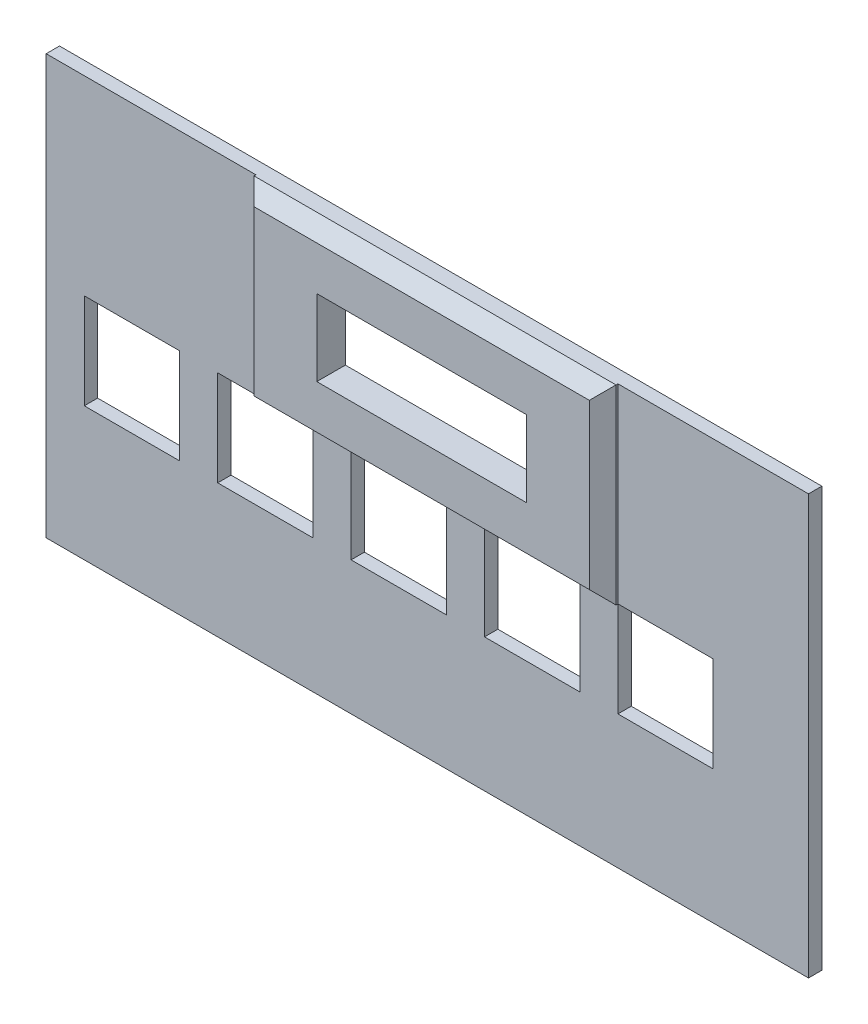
ISO-10303-21;
HEADER;
FILE_DESCRIPTION(('STEP AP214'),'2;1');
FILE_NAME('part.step','',(''),(''),'','','');
FILE_SCHEMA(('AUTOMOTIVE_DESIGN { 1 0 10303 214 1 1 1 1 }'));
ENDSEC;
DATA;
#1=APPLICATION_CONTEXT('core data for automotive mechanical design processes');
#2=APPLICATION_PROTOCOL_DEFINITION('international standard','automotive_design',2000,#1);
#3=PRODUCT_CONTEXT('',#1,'mechanical');
#4=PRODUCT('Part','Part','',(#3));
#5=PRODUCT_RELATED_PRODUCT_CATEGORY('part','',(#4));
#6=PRODUCT_DEFINITION_FORMATION('','',#4);
#7=PRODUCT_DEFINITION_CONTEXT('part definition',#1,'design');
#8=PRODUCT_DEFINITION('design','',#6,#7);
#9=PRODUCT_DEFINITION_SHAPE('','',#8);
#10=(LENGTH_UNIT() NAMED_UNIT(*) SI_UNIT(.MILLI.,.METRE.));
#11=(NAMED_UNIT(*) PLANE_ANGLE_UNIT() SI_UNIT($,.RADIAN.));
#12=(NAMED_UNIT(*) SI_UNIT($,.STERADIAN.) SOLID_ANGLE_UNIT());
#13=UNCERTAINTY_MEASURE_WITH_UNIT(LENGTH_MEASURE(1.E-05),#10,'distance_accuracy_value','');
#14=(GEOMETRIC_REPRESENTATION_CONTEXT(3) GLOBAL_UNCERTAINTY_ASSIGNED_CONTEXT((#13)) GLOBAL_UNIT_ASSIGNED_CONTEXT((#10,
#11,#12)) REPRESENTATION_CONTEXT('',''));
#15=CARTESIAN_POINT('',(0.,0.,0.));
#16=DIRECTION('',(0.,0.,1.));
#17=DIRECTION('',(1.,0.,0.));
#18=AXIS2_PLACEMENT_3D('',#15,#16,#17);
#19=CARTESIAN_POINT('',(0.,0.,0.35));
#20=DIRECTION('',(0.,0.,-1.));
#21=DIRECTION('',(-1.,0.,0.));
#22=AXIS2_PLACEMENT_3D('',#19,#20,#21);
#23=PLANE('',#22);
#24=DIRECTION('',(0.,-1.,0.));
#25=VECTOR('',#24,1.);
#26=CARTESIAN_POINT('',(-108.899490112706,112.768397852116,0.35));
#27=LINE('',#26,#25);
#28=CARTESIAN_POINT('',(-108.899490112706,112.768397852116,0.35));
#29=VERTEX_POINT('',#28);
#30=CARTESIAN_POINT('',(-108.899490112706,107.768397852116,0.35));
#31=VERTEX_POINT('',#30);
#32=EDGE_CURVE('E376',#29,#31,#27,.T.);
#33=ORIENTED_EDGE('',*,*,#32,.F.);
#34=DIRECTION('',(-1.,0.,0.));
#35=VECTOR('',#34,1.);
#36=CARTESIAN_POINT('',(-108.899490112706,112.768397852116,0.35));
#37=LINE('',#36,#35);
#38=CARTESIAN_POINT('',(-103.899490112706,112.768397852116,0.35));
#39=VERTEX_POINT('',#38);
#40=EDGE_CURVE('E384',#39,#29,#37,.T.);
#41=ORIENTED_EDGE('',*,*,#40,.F.);
#42=DIRECTION('',(0.,1.,0.));
#43=VECTOR('',#42,1.);
#44=CARTESIAN_POINT('',(-103.899490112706,112.768397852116,0.35));
#45=LINE('',#44,#43);
#46=CARTESIAN_POINT('',(-103.899490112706,107.768397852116,0.35));
#47=VERTEX_POINT('',#46);
#48=EDGE_CURVE('E381',#47,#39,#45,.T.);
#49=ORIENTED_EDGE('',*,*,#48,.F.);
#50=DIRECTION('',(1.,0.,0.));
#51=VECTOR('',#50,1.);
#52=CARTESIAN_POINT('',(-108.899490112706,107.768397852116,0.35));
#53=LINE('',#52,#51);
#54=EDGE_CURVE('E378',#31,#47,#53,.T.);
#55=ORIENTED_EDGE('',*,*,#54,.F.);
#56=EDGE_LOOP('',(#33,#41,#49,#55));
#57=FACE_BOUND('',#56,.T.);
#58=DIRECTION('',(1.,0.,0.));
#59=VECTOR('',#58,1.);
#60=CARTESIAN_POINT('',(-99.8994901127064,112.768397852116,0.35));
#61=LINE('',#60,#59);
#62=CARTESIAN_POINT('',(-96.8994901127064,112.768397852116,0.35));
#63=VERTEX_POINT('',#62);
#64=CARTESIAN_POINT('',(-94.8994901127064,112.768397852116,0.35));
#65=VERTEX_POINT('',#64);
#66=EDGE_CURVE('E285',#63,#65,#61,.T.);
#67=ORIENTED_EDGE('',*,*,#66,.F.);
#68=DIRECTION('',(0.,1.,0.));
#69=VECTOR('',#68,1.);
#70=CARTESIAN_POINT('',(-96.8994901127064,112.768397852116,0.35));
#71=LINE('',#70,#69);
#72=CARTESIAN_POINT('',(-96.8994901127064,107.768397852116,0.35));
#73=VERTEX_POINT('',#72);
#74=EDGE_CURVE('E445',#73,#63,#71,.T.);
#75=ORIENTED_EDGE('',*,*,#74,.F.);
#76=DIRECTION('',(1.,0.,0.));
#77=VECTOR('',#76,1.);
#78=CARTESIAN_POINT('',(-101.899490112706,107.768397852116,0.35));
#79=LINE('',#78,#77);
#80=CARTESIAN_POINT('',(-101.899490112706,107.768397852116,0.35));
#81=VERTEX_POINT('',#80);
#82=EDGE_CURVE('E442',#81,#73,#79,.T.);
#83=ORIENTED_EDGE('',*,*,#82,.F.);
#84=DIRECTION('',(0.,-1.,0.));
#85=VECTOR('',#84,1.);
#86=CARTESIAN_POINT('',(-101.899490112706,112.768397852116,0.35));
#87=LINE('',#86,#85);
#88=CARTESIAN_POINT('',(-101.899490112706,112.768397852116,0.35));
#89=VERTEX_POINT('',#88);
#90=EDGE_CURVE('E439',#89,#81,#87,.T.);
#91=ORIENTED_EDGE('',*,*,#90,.F.);
#92=DIRECTION('',(-1.,0.,0.));
#93=VECTOR('',#92,1.);
#94=CARTESIAN_POINT('',(-101.899490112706,112.768397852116,0.35));
#95=LINE('',#94,#93);
#96=CARTESIAN_POINT('',(-99.8994901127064,112.768397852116,0.35));
#97=VERTEX_POINT('',#96);
#98=EDGE_CURVE('E437',#97,#89,#95,.T.);
#99=ORIENTED_EDGE('',*,*,#98,.F.);
#100=DIRECTION('',(0.,-1.,0.));
#101=VECTOR('',#100,1.);
#102=CARTESIAN_POINT('',(-99.8994901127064,122.768397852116,0.35));
#103=LINE('',#102,#101);
#104=CARTESIAN_POINT('',(-99.8994901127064,122.768397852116,0.35));
#105=VERTEX_POINT('',#104);
#106=EDGE_CURVE('E281',#105,#97,#103,.T.);
#107=ORIENTED_EDGE('',*,*,#106,.F.);
#108=DIRECTION('',(-1.,0.,0.));
#109=VECTOR('',#108,1.);
#110=CARTESIAN_POINT('',(-110.899490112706,122.768397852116,0.35));
#111=LINE('',#110,#109);
#112=CARTESIAN_POINT('',(-110.899490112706,122.768397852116,0.35));
#113=VERTEX_POINT('',#112);
#114=EDGE_CURVE('E477',#105,#113,#111,.T.);
#115=ORIENTED_EDGE('',*,*,#114,.T.);
#116=DIRECTION('',(0.,-1.,0.));
#117=VECTOR('',#116,1.);
#118=CARTESIAN_POINT('',(-110.899490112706,122.768397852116,0.35));
#119=LINE('',#118,#117);
#120=CARTESIAN_POINT('',(-110.899490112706,100.768397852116,0.35));
#121=VERTEX_POINT('',#120);
#122=EDGE_CURVE('E469',#113,#121,#119,.T.);
#123=ORIENTED_EDGE('',*,*,#122,.T.);
#124=DIRECTION('',(1.,0.,0.));
#125=VECTOR('',#124,1.);
#126=CARTESIAN_POINT('',(-70.8994901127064,100.768397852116,0.35));
#127=LINE('',#126,#125);
#128=CARTESIAN_POINT('',(-70.8994901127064,100.768397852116,0.35));
#129=VERTEX_POINT('',#128);
#130=EDGE_CURVE('E472',#121,#129,#127,.T.);
#131=ORIENTED_EDGE('',*,*,#130,.T.);
#132=DIRECTION('',(0.,1.,0.));
#133=VECTOR('',#132,1.);
#134=CARTESIAN_POINT('',(-70.8994901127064,122.768397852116,0.35));
#135=LINE('',#134,#133);
#136=CARTESIAN_POINT('',(-70.8994901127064,122.768397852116,0.35));
#137=VERTEX_POINT('',#136);
#138=EDGE_CURVE('E475',#129,#137,#135,.T.);
#139=ORIENTED_EDGE('',*,*,#138,.T.);
#140=CARTESIAN_POINT('',(-80.8994901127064,122.768397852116,0.35));
#141=VERTEX_POINT('',#140);
#142=EDGE_CURVE('E478',#137,#141,#111,.T.);
#143=ORIENTED_EDGE('',*,*,#142,.T.);
#144=DIRECTION('',(0.,1.,0.));
#145=VECTOR('',#144,1.);
#146=CARTESIAN_POINT('',(-80.8994901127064,122.768397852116,0.35));
#147=LINE('',#146,#145);
#148=CARTESIAN_POINT('',(-80.8994901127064,112.768397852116,0.35));
#149=VERTEX_POINT('',#148);
#150=EDGE_CURVE('E284',#149,#141,#147,.T.);
#151=ORIENTED_EDGE('',*,*,#150,.F.);
#152=DIRECTION('',(-1.,0.,0.));
#153=VECTOR('',#152,1.);
#154=CARTESIAN_POINT('',(-80.8994901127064,112.768397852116,0.35));
#155=LINE('',#154,#153);
#156=CARTESIAN_POINT('',(-75.8994901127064,112.768397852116,0.35));
#157=VERTEX_POINT('',#156);
#158=EDGE_CURVE('E302',#157,#149,#155,.T.);
#159=ORIENTED_EDGE('',*,*,#158,.F.);
#160=DIRECTION('',(0.,1.,0.));
#161=VECTOR('',#160,1.);
#162=CARTESIAN_POINT('',(-75.8994901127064,112.768397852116,0.35));
#163=LINE('',#162,#161);
#164=CARTESIAN_POINT('',(-75.8994901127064,107.768397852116,0.35));
#165=VERTEX_POINT('',#164);
#166=EDGE_CURVE('E311',#165,#157,#163,.T.);
#167=ORIENTED_EDGE('',*,*,#166,.F.);
#168=DIRECTION('',(1.,0.,0.));
#169=VECTOR('',#168,1.);
#170=CARTESIAN_POINT('',(-80.8994901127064,107.768397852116,0.35));
#171=LINE('',#170,#169);
#172=CARTESIAN_POINT('',(-80.8994901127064,107.768397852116,0.35));
#173=VERTEX_POINT('',#172);
#174=EDGE_CURVE('E308',#173,#165,#171,.T.);
#175=ORIENTED_EDGE('',*,*,#174,.F.);
#176=DIRECTION('',(0.,-1.,0.));
#177=VECTOR('',#176,1.);
#178=CARTESIAN_POINT('',(-80.8994901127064,112.768397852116,0.35));
#179=LINE('',#178,#177);
#180=EDGE_CURVE('E305',#149,#173,#179,.T.);
#181=ORIENTED_EDGE('',*,*,#180,.F.);
#182=CARTESIAN_POINT('',(-82.8994901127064,112.768397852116,0.35));
#183=VERTEX_POINT('',#182);
#184=EDGE_CURVE('E290',#183,#149,#61,.T.);
#185=ORIENTED_EDGE('',*,*,#184,.F.);
#186=DIRECTION('',(0.,1.,0.));
#187=VECTOR('',#186,1.);
#188=CARTESIAN_POINT('',(-82.8994901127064,112.768397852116,0.35));
#189=LINE('',#188,#187);
#190=CARTESIAN_POINT('',(-82.8994901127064,107.768397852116,0.35));
#191=VERTEX_POINT('',#190);
#192=EDGE_CURVE('E340',#191,#183,#189,.T.);
#193=ORIENTED_EDGE('',*,*,#192,.F.);
#194=DIRECTION('',(1.,0.,0.));
#195=VECTOR('',#194,1.);
#196=CARTESIAN_POINT('',(-87.8994901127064,107.768397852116,0.35));
#197=LINE('',#196,#195);
#198=CARTESIAN_POINT('',(-87.8994901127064,107.768397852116,0.35));
#199=VERTEX_POINT('',#198);
#200=EDGE_CURVE('E336',#199,#191,#197,.T.);
#201=ORIENTED_EDGE('',*,*,#200,.F.);
#202=DIRECTION('',(0.,-1.,0.));
#203=VECTOR('',#202,1.);
#204=CARTESIAN_POINT('',(-87.8994901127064,112.768397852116,0.35));
#205=LINE('',#204,#203);
#206=CARTESIAN_POINT('',(-87.8994901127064,112.768397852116,0.35));
#207=VERTEX_POINT('',#206);
#208=EDGE_CURVE('E334',#207,#199,#205,.T.);
#209=ORIENTED_EDGE('',*,*,#208,.F.);
#210=CARTESIAN_POINT('',(-89.8994901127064,112.768397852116,0.35));
#211=VERTEX_POINT('',#210);
#212=EDGE_CURVE('E289',#211,#207,#61,.T.);
#213=ORIENTED_EDGE('',*,*,#212,.F.);
#214=DIRECTION('',(0.,1.,0.));
#215=VECTOR('',#214,1.);
#216=CARTESIAN_POINT('',(-89.8994901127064,112.768397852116,0.35));
#217=LINE('',#216,#215);
#218=CARTESIAN_POINT('',(-89.8994901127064,107.768397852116,0.35));
#219=VERTEX_POINT('',#218);
#220=EDGE_CURVE('E413',#219,#211,#217,.T.);
#221=ORIENTED_EDGE('',*,*,#220,.F.);
#222=DIRECTION('',(1.,0.,0.));
#223=VECTOR('',#222,1.);
#224=CARTESIAN_POINT('',(-94.8994901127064,107.768397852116,0.35));
#225=LINE('',#224,#223);
#226=CARTESIAN_POINT('',(-94.8994901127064,107.768397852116,0.35));
#227=VERTEX_POINT('',#226);
#228=EDGE_CURVE('E409',#227,#219,#225,.T.);
#229=ORIENTED_EDGE('',*,*,#228,.F.);
#230=DIRECTION('',(0.,-1.,0.));
#231=VECTOR('',#230,1.);
#232=CARTESIAN_POINT('',(-94.8994901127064,112.768397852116,0.35));
#233=LINE('',#232,#231);
#234=EDGE_CURVE('E407',#65,#227,#233,.T.);
#235=ORIENTED_EDGE('',*,*,#234,.F.);
#236=EDGE_LOOP('',(#67,#75,#83,#91,#99,#107,#115,#123,#131,#139,#143,#151,#159,#167,#175,#181,
#185,#193,#201,#209,#213,#221,#229,#235));
#237=FACE_BOUND('',#236,.T.);
#238=ADVANCED_FACE('F33',(#57,#237),#23,.F.);
#239=CARTESIAN_POINT('',(0.,0.,-0.35));
#240=DIRECTION('',(0.,0.,-1.));
#241=DIRECTION('',(-1.,0.,0.));
#242=AXIS2_PLACEMENT_3D('',#239,#240,#241);
#243=PLANE('',#242);
#244=DIRECTION('',(0.,-1.,0.));
#245=VECTOR('',#244,1.);
#246=CARTESIAN_POINT('',(-110.899490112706,122.768397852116,-0.35));
#247=LINE('',#246,#245);
#248=CARTESIAN_POINT('',(-110.899490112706,122.768397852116,-0.35));
#249=VERTEX_POINT('',#248);
#250=CARTESIAN_POINT('',(-110.899490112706,100.768397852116,-0.35));
#251=VERTEX_POINT('',#250);
#252=EDGE_CURVE('E468',#249,#251,#247,.T.);
#253=ORIENTED_EDGE('',*,*,#252,.F.);
#254=DIRECTION('',(-1.,0.,0.));
#255=VECTOR('',#254,1.);
#256=CARTESIAN_POINT('',(-110.899490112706,122.768397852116,-0.35));
#257=LINE('',#256,#255);
#258=CARTESIAN_POINT('',(-70.8994901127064,122.768397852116,-0.35));
#259=VERTEX_POINT('',#258);
#260=EDGE_CURVE('E473',#259,#249,#257,.T.);
#261=ORIENTED_EDGE('',*,*,#260,.F.);
#262=DIRECTION('',(0.,1.,0.));
#263=VECTOR('',#262,1.);
#264=CARTESIAN_POINT('',(-70.8994901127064,122.768397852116,-0.35));
#265=LINE('',#264,#263);
#266=CARTESIAN_POINT('',(-70.8994901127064,100.768397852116,-0.35));
#267=VERTEX_POINT('',#266);
#268=EDGE_CURVE('E486',#267,#259,#265,.T.);
#269=ORIENTED_EDGE('',*,*,#268,.F.);
#270=DIRECTION('',(1.,0.,0.));
#271=VECTOR('',#270,1.);
#272=CARTESIAN_POINT('',(-70.8994901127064,100.768397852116,-0.35));
#273=LINE('',#272,#271);
#274=EDGE_CURVE('E484',#251,#267,#273,.T.);
#275=ORIENTED_EDGE('',*,*,#274,.F.);
#276=EDGE_LOOP('',(#253,#261,#269,#275));
#277=FACE_BOUND('',#276,.T.);
#278=DIRECTION('',(0.,1.,0.));
#279=VECTOR('',#278,1.);
#280=CARTESIAN_POINT('',(-96.8994901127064,112.768397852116,-0.35));
#281=LINE('',#280,#279);
#282=CARTESIAN_POINT('',(-96.8994901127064,107.768397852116,-0.35));
#283=VERTEX_POINT('',#282);
#284=CARTESIAN_POINT('',(-96.8994901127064,112.768397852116,-0.35));
#285=VERTEX_POINT('',#284);
#286=EDGE_CURVE('E440',#283,#285,#281,.T.);
#287=ORIENTED_EDGE('',*,*,#286,.T.);
#288=DIRECTION('',(-1.,0.,0.));
#289=VECTOR('',#288,1.);
#290=CARTESIAN_POINT('',(-101.899490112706,112.768397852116,-0.35));
#291=LINE('',#290,#289);
#292=CARTESIAN_POINT('',(-101.899490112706,112.768397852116,-0.35));
#293=VERTEX_POINT('',#292);
#294=EDGE_CURVE('E436',#285,#293,#291,.T.);
#295=ORIENTED_EDGE('',*,*,#294,.T.);
#296=DIRECTION('',(0.,-1.,0.));
#297=VECTOR('',#296,1.);
#298=CARTESIAN_POINT('',(-101.899490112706,112.768397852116,-0.35));
#299=LINE('',#298,#297);
#300=CARTESIAN_POINT('',(-101.899490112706,107.768397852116,-0.35));
#301=VERTEX_POINT('',#300);
#302=EDGE_CURVE('E451',#293,#301,#299,.T.);
#303=ORIENTED_EDGE('',*,*,#302,.T.);
#304=DIRECTION('',(1.,0.,0.));
#305=VECTOR('',#304,1.);
#306=CARTESIAN_POINT('',(-101.899490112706,107.768397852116,-0.35));
#307=LINE('',#306,#305);
#308=EDGE_CURVE('E454',#301,#283,#307,.T.);
#309=ORIENTED_EDGE('',*,*,#308,.T.);
#310=EDGE_LOOP('',(#287,#295,#303,#309));
#311=FACE_BOUND('',#310,.T.);
#312=DIRECTION('',(0.,1.,0.));
#313=VECTOR('',#312,1.);
#314=CARTESIAN_POINT('',(-89.8994901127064,112.768397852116,-0.35));
#315=LINE('',#314,#313);
#316=CARTESIAN_POINT('',(-89.8994901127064,107.768397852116,-0.35));
#317=VERTEX_POINT('',#316);
#318=CARTESIAN_POINT('',(-89.8994901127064,112.768397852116,-0.35));
#319=VERTEX_POINT('',#318);
#320=EDGE_CURVE('E410',#317,#319,#315,.T.);
#321=ORIENTED_EDGE('',*,*,#320,.T.);
#322=DIRECTION('',(-1.,0.,0.));
#323=VECTOR('',#322,1.);
#324=CARTESIAN_POINT('',(-94.8994901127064,112.768397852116,-0.35));
#325=LINE('',#324,#323);
#326=CARTESIAN_POINT('',(-94.8994901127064,112.768397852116,-0.35));
#327=VERTEX_POINT('',#326);
#328=EDGE_CURVE('E406',#319,#327,#325,.T.);
#329=ORIENTED_EDGE('',*,*,#328,.T.);
#330=DIRECTION('',(0.,-1.,0.));
#331=VECTOR('',#330,1.);
#332=CARTESIAN_POINT('',(-94.8994901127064,112.768397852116,-0.35));
#333=LINE('',#332,#331);
#334=CARTESIAN_POINT('',(-94.8994901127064,107.768397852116,-0.35));
#335=VERTEX_POINT('',#334);
#336=EDGE_CURVE('E419',#327,#335,#333,.T.);
#337=ORIENTED_EDGE('',*,*,#336,.T.);
#338=DIRECTION('',(1.,0.,0.));
#339=VECTOR('',#338,1.);
#340=CARTESIAN_POINT('',(-94.8994901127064,107.768397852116,-0.35));
#341=LINE('',#340,#339);
#342=EDGE_CURVE('E422',#335,#317,#341,.T.);
#343=ORIENTED_EDGE('',*,*,#342,.T.);
#344=EDGE_LOOP('',(#321,#329,#337,#343));
#345=FACE_BOUND('',#344,.T.);
#346=DIRECTION('',(-1.,0.,0.));
#347=VECTOR('',#346,1.);
#348=CARTESIAN_POINT('',(-108.899490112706,112.768397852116,-0.35));
#349=LINE('',#348,#347);
#350=CARTESIAN_POINT('',(-103.899490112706,112.768397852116,-0.35));
#351=VERTEX_POINT('',#350);
#352=CARTESIAN_POINT('',(-108.899490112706,112.768397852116,-0.35));
#353=VERTEX_POINT('',#352);
#354=EDGE_CURVE('E379',#351,#353,#349,.T.);
#355=ORIENTED_EDGE('',*,*,#354,.T.);
#356=DIRECTION('',(0.,-1.,0.));
#357=VECTOR('',#356,1.);
#358=CARTESIAN_POINT('',(-108.899490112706,112.768397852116,-0.35));
#359=LINE('',#358,#357);
#360=CARTESIAN_POINT('',(-108.899490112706,107.768397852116,-0.35));
#361=VERTEX_POINT('',#360);
#362=EDGE_CURVE('E261',#353,#361,#359,.T.);
#363=ORIENTED_EDGE('',*,*,#362,.T.);
#364=DIRECTION('',(1.,0.,0.));
#365=VECTOR('',#364,1.);
#366=CARTESIAN_POINT('',(-108.899490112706,107.768397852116,-0.35));
#367=LINE('',#366,#365);
#368=CARTESIAN_POINT('',(-103.899490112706,107.768397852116,-0.35));
#369=VERTEX_POINT('',#368);
#370=EDGE_CURVE('E389',#361,#369,#367,.T.);
#371=ORIENTED_EDGE('',*,*,#370,.T.);
#372=DIRECTION('',(0.,1.,0.));
#373=VECTOR('',#372,1.);
#374=CARTESIAN_POINT('',(-103.899490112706,112.768397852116,-0.35));
#375=LINE('',#374,#373);
#376=EDGE_CURVE('E392',#369,#351,#375,.T.);
#377=ORIENTED_EDGE('',*,*,#376,.T.);
#378=EDGE_LOOP('',(#355,#363,#371,#377));
#379=FACE_BOUND('',#378,.T.);
#380=DIRECTION('',(-1.,0.,0.));
#381=VECTOR('',#380,1.);
#382=CARTESIAN_POINT('',(-95.8994901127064,119.768397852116,-0.35));
#383=LINE('',#382,#381);
#384=CARTESIAN_POINT('',(-84.8994901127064,119.768397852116,-0.35));
#385=VERTEX_POINT('',#384);
#386=CARTESIAN_POINT('',(-95.8994901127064,119.768397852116,-0.35));
#387=VERTEX_POINT('',#386);
#388=EDGE_CURVE('E369',#385,#387,#383,.T.);
#389=ORIENTED_EDGE('',*,*,#388,.T.);
#390=DIRECTION('',(0.,-1.,0.));
#391=VECTOR('',#390,1.);
#392=CARTESIAN_POINT('',(-95.8994901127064,119.768397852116,-0.35));
#393=LINE('',#392,#391);
#394=CARTESIAN_POINT('',(-95.8994901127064,115.768397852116,-0.35));
#395=VERTEX_POINT('',#394);
#396=EDGE_CURVE('E363',#387,#395,#393,.T.);
#397=ORIENTED_EDGE('',*,*,#396,.T.);
#398=DIRECTION('',(1.,0.,0.));
#399=VECTOR('',#398,1.);
#400=CARTESIAN_POINT('',(-95.8994901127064,115.768397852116,-0.35));
#401=LINE('',#400,#399);
#402=CARTESIAN_POINT('',(-84.8994901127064,115.768397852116,-0.35));
#403=VERTEX_POINT('',#402);
#404=EDGE_CURVE('E258',#395,#403,#401,.T.);
#405=ORIENTED_EDGE('',*,*,#404,.T.);
#406=DIRECTION('',(0.,1.,0.));
#407=VECTOR('',#406,1.);
#408=CARTESIAN_POINT('',(-84.8994901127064,119.768397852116,-0.35));
#409=LINE('',#408,#407);
#410=EDGE_CURVE('E366',#403,#385,#409,.T.);
#411=ORIENTED_EDGE('',*,*,#410,.T.);
#412=EDGE_LOOP('',(#389,#397,#405,#411));
#413=FACE_BOUND('',#412,.T.);
#414=DIRECTION('',(0.,1.,0.));
#415=VECTOR('',#414,1.);
#416=CARTESIAN_POINT('',(-82.8994901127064,112.768397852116,-0.35));
#417=LINE('',#416,#415);
#418=CARTESIAN_POINT('',(-82.8994901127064,107.768397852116,-0.35));
#419=VERTEX_POINT('',#418);
#420=CARTESIAN_POINT('',(-82.8994901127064,112.768397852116,-0.35));
#421=VERTEX_POINT('',#420);
#422=EDGE_CURVE('E337',#419,#421,#417,.T.);
#423=ORIENTED_EDGE('',*,*,#422,.T.);
#424=DIRECTION('',(-1.,0.,0.));
#425=VECTOR('',#424,1.);
#426=CARTESIAN_POINT('',(-87.8994901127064,112.768397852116,-0.35));
#427=LINE('',#426,#425);
#428=CARTESIAN_POINT('',(-87.8994901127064,112.768397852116,-0.35));
#429=VERTEX_POINT('',#428);
#430=EDGE_CURVE('E333',#421,#429,#427,.T.);
#431=ORIENTED_EDGE('',*,*,#430,.T.);
#432=DIRECTION('',(0.,-1.,0.));
#433=VECTOR('',#432,1.);
#434=CARTESIAN_POINT('',(-87.8994901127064,112.768397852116,-0.35));
#435=LINE('',#434,#433);
#436=CARTESIAN_POINT('',(-87.8994901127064,107.768397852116,-0.35));
#437=VERTEX_POINT('',#436);
#438=EDGE_CURVE('E346',#429,#437,#435,.T.);
#439=ORIENTED_EDGE('',*,*,#438,.T.);
#440=DIRECTION('',(1.,0.,0.));
#441=VECTOR('',#440,1.);
#442=CARTESIAN_POINT('',(-87.8994901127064,107.768397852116,-0.35));
#443=LINE('',#442,#441);
#444=EDGE_CURVE('E349',#437,#419,#443,.T.);
#445=ORIENTED_EDGE('',*,*,#444,.T.);
#446=EDGE_LOOP('',(#423,#431,#439,#445));
#447=FACE_BOUND('',#446,.T.);
#448=DIRECTION('',(0.,1.,0.));
#449=VECTOR('',#448,1.);
#450=CARTESIAN_POINT('',(-75.8994901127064,112.768397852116,-0.35));
#451=LINE('',#450,#449);
#452=CARTESIAN_POINT('',(-75.8994901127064,107.768397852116,-0.35));
#453=VERTEX_POINT('',#452);
#454=CARTESIAN_POINT('',(-75.8994901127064,112.768397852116,-0.35));
#455=VERTEX_POINT('',#454);
#456=EDGE_CURVE('E306',#453,#455,#451,.T.);
#457=ORIENTED_EDGE('',*,*,#456,.T.);
#458=DIRECTION('',(-1.,0.,0.));
#459=VECTOR('',#458,1.);
#460=CARTESIAN_POINT('',(-80.8994901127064,112.768397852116,-0.35));
#461=LINE('',#460,#459);
#462=CARTESIAN_POINT('',(-80.8994901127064,112.768397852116,-0.35));
#463=VERTEX_POINT('',#462);
#464=EDGE_CURVE('E301',#455,#463,#461,.T.);
#465=ORIENTED_EDGE('',*,*,#464,.T.);
#466=DIRECTION('',(0.,-1.,0.));
#467=VECTOR('',#466,1.);
#468=CARTESIAN_POINT('',(-80.8994901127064,112.768397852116,-0.35));
#469=LINE('',#468,#467);
#470=CARTESIAN_POINT('',(-80.8994901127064,107.768397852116,-0.35));
#471=VERTEX_POINT('',#470);
#472=EDGE_CURVE('E316',#463,#471,#469,.T.);
#473=ORIENTED_EDGE('',*,*,#472,.T.);
#474=DIRECTION('',(1.,0.,0.));
#475=VECTOR('',#474,1.);
#476=CARTESIAN_POINT('',(-80.8994901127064,107.768397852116,-0.35));
#477=LINE('',#476,#475);
#478=EDGE_CURVE('E319',#471,#453,#477,.T.);
#479=ORIENTED_EDGE('',*,*,#478,.T.);
#480=EDGE_LOOP('',(#457,#465,#473,#479));
#481=FACE_BOUND('',#480,.T.);
#482=ADVANCED_FACE('F560',(#277,#311,#345,#379,#413,#447,#481),#243,.T.);
#483=CARTESIAN_POINT('',(-110.899490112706,122.768397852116,0.35));
#484=DIRECTION('',(1.,0.,0.));
#485=DIRECTION('',(0.,1.,0.));
#486=AXIS2_PLACEMENT_3D('',#483,#484,#485);
#487=PLANE('',#486);
#488=ORIENTED_EDGE('',*,*,#252,.T.);
#489=DIRECTION('',(0.,0.,-1.));
#490=VECTOR('',#489,1.);
#491=CARTESIAN_POINT('',(-110.899490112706,100.768397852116,0.35));
#492=LINE('',#491,#490);
#493=EDGE_CURVE('E497',#121,#251,#492,.T.);
#494=ORIENTED_EDGE('',*,*,#493,.F.);
#495=ORIENTED_EDGE('',*,*,#122,.F.);
#496=DIRECTION('',(0.,0.,-1.));
#497=VECTOR('',#496,1.);
#498=CARTESIAN_POINT('',(-110.899490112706,122.768397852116,0.35));
#499=LINE('',#498,#497);
#500=EDGE_CURVE('E481',#113,#249,#499,.T.);
#501=ORIENTED_EDGE('',*,*,#500,.T.);
#502=EDGE_LOOP('',(#488,#494,#495,#501));
#503=FACE_BOUND('',#502,.T.);
#504=ADVANCED_FACE('F566',(#503),#487,.F.);
#505=CARTESIAN_POINT('',(-70.8994901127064,100.768397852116,0.35));
#506=DIRECTION('',(0.,1.,0.));
#507=DIRECTION('',(0.,0.,1.));
#508=AXIS2_PLACEMENT_3D('',#505,#506,#507);
#509=PLANE('',#508);
#510=ORIENTED_EDGE('',*,*,#274,.T.);
#511=DIRECTION('',(0.,0.,-1.));
#512=VECTOR('',#511,1.);
#513=CARTESIAN_POINT('',(-70.8994901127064,100.768397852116,0.35));
#514=LINE('',#513,#512);
#515=EDGE_CURVE('E494',#129,#267,#514,.T.);
#516=ORIENTED_EDGE('',*,*,#515,.F.);
#517=ORIENTED_EDGE('',*,*,#130,.F.);
#518=ORIENTED_EDGE('',*,*,#493,.T.);
#519=EDGE_LOOP('',(#510,#516,#517,#518));
#520=FACE_BOUND('',#519,.T.);
#521=ADVANCED_FACE('F580',(#520),#509,.F.);
#522=CARTESIAN_POINT('',(-70.8994901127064,122.768397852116,0.35));
#523=DIRECTION('',(-1.,0.,0.));
#524=DIRECTION('',(0.,0.,1.));
#525=AXIS2_PLACEMENT_3D('',#522,#523,#524);
#526=PLANE('',#525);
#527=ORIENTED_EDGE('',*,*,#268,.T.);
#528=DIRECTION('',(0.,0.,-1.));
#529=VECTOR('',#528,1.);
#530=CARTESIAN_POINT('',(-70.8994901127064,122.768397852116,0.35));
#531=LINE('',#530,#529);
#532=EDGE_CURVE('E491',#137,#259,#531,.T.);
#533=ORIENTED_EDGE('',*,*,#532,.F.);
#534=ORIENTED_EDGE('',*,*,#138,.F.);
#535=ORIENTED_EDGE('',*,*,#515,.T.);
#536=EDGE_LOOP('',(#527,#533,#534,#535));
#537=FACE_BOUND('',#536,.T.);
#538=ADVANCED_FACE('F577',(#537),#526,.F.);
#539=CARTESIAN_POINT('',(-110.899490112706,122.768397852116,0.35));
#540=DIRECTION('',(0.,-1.,0.));
#541=DIRECTION('',(1.,0.,0.));
#542=AXIS2_PLACEMENT_3D('',#539,#540,#541);
#543=PLANE('',#542);
#544=DIRECTION('',(0.,0.,-1.));
#545=VECTOR('',#544,1.);
#546=CARTESIAN_POINT('',(-99.8994901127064,122.768397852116,1.15));
#547=LINE('',#546,#545);
#548=CARTESIAN_POINT('',(-99.8994901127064,122.768397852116,0.449999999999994));
#549=VERTEX_POINT('',#548);
#550=EDGE_CURVE('E299',#549,#105,#547,.T.);
#551=ORIENTED_EDGE('',*,*,#550,.F.);
#552=DIRECTION('',(1.,0.,0.));
#553=VECTOR('',#552,1.);
#554=CARTESIAN_POINT('',(-110.899490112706,122.768397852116,0.449999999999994));
#555=LINE('',#554,#553);
#556=CARTESIAN_POINT('',(-80.8994901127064,122.768397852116,0.449999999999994));
#557=VERTEX_POINT('',#556);
#558=EDGE_CURVE('E11',#549,#557,#555,.T.);
#559=ORIENTED_EDGE('',*,*,#558,.T.);
#560=DIRECTION('',(0.,0.,-1.));
#561=VECTOR('',#560,1.);
#562=CARTESIAN_POINT('',(-80.8994901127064,122.768397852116,1.15));
#563=LINE('',#562,#561);
#564=EDGE_CURVE('E293',#557,#141,#563,.T.);
#565=ORIENTED_EDGE('',*,*,#564,.T.);
#566=ORIENTED_EDGE('',*,*,#142,.F.);
#567=ORIENTED_EDGE('',*,*,#532,.T.);
#568=ORIENTED_EDGE('',*,*,#260,.T.);
#569=ORIENTED_EDGE('',*,*,#500,.F.);
#570=ORIENTED_EDGE('',*,*,#114,.F.);
#571=EDGE_LOOP('',(#551,#559,#565,#566,#567,#568,#569,#570));
#572=FACE_BOUND('',#571,.T.);
#573=ADVANCED_FACE('F574',(#572),#543,.F.);
#574=CARTESIAN_POINT('',(-101.899490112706,112.768397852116,0.35));
#575=DIRECTION('',(0.,-1.,0.));
#576=DIRECTION('',(1.,0.,0.));
#577=AXIS2_PLACEMENT_3D('',#574,#575,#576);
#578=PLANE('',#577);
#579=DIRECTION('',(0.,0.,-1.));
#580=VECTOR('',#579,1.);
#581=CARTESIAN_POINT('',(-80.8994901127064,112.768397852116,1.15));
#582=LINE('',#581,#580);
#583=CARTESIAN_POINT('',(-80.8994901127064,112.768397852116,0.449999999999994));
#584=VERTEX_POINT('',#583);
#585=EDGE_CURVE('E295',#584,#149,#582,.T.);
#586=ORIENTED_EDGE('',*,*,#585,.F.);
#587=DIRECTION('',(-1.,0.,0.));
#588=VECTOR('',#587,1.);
#589=CARTESIAN_POINT('',(-99.8994901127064,112.768397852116,0.449999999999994));
#590=LINE('',#589,#588);
#591=CARTESIAN_POINT('',(-99.8994901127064,112.768397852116,0.449999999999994));
#592=VERTEX_POINT('',#591);
#593=EDGE_CURVE('E508',#584,#592,#590,.T.);
#594=ORIENTED_EDGE('',*,*,#593,.T.);
#595=DIRECTION('',(0.,0.,-1.));
#596=VECTOR('',#595,1.);
#597=CARTESIAN_POINT('',(-99.8994901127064,112.768397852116,1.15));
#598=LINE('',#597,#596);
#599=EDGE_CURVE('E297',#592,#97,#598,.T.);
#600=ORIENTED_EDGE('',*,*,#599,.T.);
#601=ORIENTED_EDGE('',*,*,#98,.T.);
#602=DIRECTION('',(0.,0.,-1.));
#603=VECTOR('',#602,1.);
#604=CARTESIAN_POINT('',(-101.899490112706,112.768397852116,0.35));
#605=LINE('',#604,#603);
#606=EDGE_CURVE('E465',#89,#293,#605,.T.);
#607=ORIENTED_EDGE('',*,*,#606,.T.);
#608=ORIENTED_EDGE('',*,*,#294,.F.);
#609=DIRECTION('',(0.,0.,-1.));
#610=VECTOR('',#609,1.);
#611=CARTESIAN_POINT('',(-96.8994901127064,112.768397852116,0.35));
#612=LINE('',#611,#610);
#613=EDGE_CURVE('E448',#63,#285,#612,.T.);
#614=ORIENTED_EDGE('',*,*,#613,.F.);
#615=ORIENTED_EDGE('',*,*,#66,.T.);
#616=DIRECTION('',(0.,0.,-1.));
#617=VECTOR('',#616,1.);
#618=CARTESIAN_POINT('',(-94.8994901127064,112.768397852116,0.35));
#619=LINE('',#618,#617);
#620=EDGE_CURVE('E433',#65,#327,#619,.T.);
#621=ORIENTED_EDGE('',*,*,#620,.T.);
#622=ORIENTED_EDGE('',*,*,#328,.F.);
#623=DIRECTION('',(0.,0.,-1.));
#624=VECTOR('',#623,1.);
#625=CARTESIAN_POINT('',(-89.8994901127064,112.768397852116,0.35));
#626=LINE('',#625,#624);
#627=EDGE_CURVE('E416',#211,#319,#626,.T.);
#628=ORIENTED_EDGE('',*,*,#627,.F.);
#629=ORIENTED_EDGE('',*,*,#212,.T.);
#630=DIRECTION('',(0.,0.,-1.));
#631=VECTOR('',#630,1.);
#632=CARTESIAN_POINT('',(-87.8994901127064,112.768397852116,0.35));
#633=LINE('',#632,#631);
#634=EDGE_CURVE('E360',#207,#429,#633,.T.);
#635=ORIENTED_EDGE('',*,*,#634,.T.);
#636=ORIENTED_EDGE('',*,*,#430,.F.);
#637=DIRECTION('',(0.,0.,-1.));
#638=VECTOR('',#637,1.);
#639=CARTESIAN_POINT('',(-82.8994901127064,112.768397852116,0.35));
#640=LINE('',#639,#638);
#641=EDGE_CURVE('E343',#183,#421,#640,.T.);
#642=ORIENTED_EDGE('',*,*,#641,.F.);
#643=ORIENTED_EDGE('',*,*,#184,.T.);
#644=EDGE_LOOP('',(#586,#594,#600,#601,#607,#608,#614,#615,#621,#622,#628,#629,#635,#636,#642,#643));
#645=FACE_BOUND('',#644,.T.);
#646=ADVANCED_FACE('F540',(#645),#578,.T.);
#647=CARTESIAN_POINT('',(-101.899490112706,112.768397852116,0.35));
#648=DIRECTION('',(1.,0.,0.));
#649=DIRECTION('',(0.,1.,0.));
#650=AXIS2_PLACEMENT_3D('',#647,#648,#649);
#651=PLANE('',#650);
#652=ORIENTED_EDGE('',*,*,#302,.F.);
#653=ORIENTED_EDGE('',*,*,#606,.F.);
#654=ORIENTED_EDGE('',*,*,#90,.T.);
#655=DIRECTION('',(0.,0.,-1.));
#656=VECTOR('',#655,1.);
#657=CARTESIAN_POINT('',(-101.899490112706,107.768397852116,0.35));
#658=LINE('',#657,#656);
#659=EDGE_CURVE('E463',#81,#301,#658,.T.);
#660=ORIENTED_EDGE('',*,*,#659,.T.);
#661=EDGE_LOOP('',(#652,#653,#654,#660));
#662=FACE_BOUND('',#661,.T.);
#663=ADVANCED_FACE('F670',(#662),#651,.T.);
#664=CARTESIAN_POINT('',(-101.899490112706,107.768397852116,0.35));
#665=DIRECTION('',(0.,1.,0.));
#666=DIRECTION('',(0.,0.,1.));
#667=AXIS2_PLACEMENT_3D('',#664,#665,#666);
#668=PLANE('',#667);
#669=ORIENTED_EDGE('',*,*,#308,.F.);
#670=ORIENTED_EDGE('',*,*,#659,.F.);
#671=ORIENTED_EDGE('',*,*,#82,.T.);
#672=DIRECTION('',(0.,0.,-1.));
#673=VECTOR('',#672,1.);
#674=CARTESIAN_POINT('',(-96.8994901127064,107.768397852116,0.35));
#675=LINE('',#674,#673);
#676=EDGE_CURVE('E461',#73,#283,#675,.T.);
#677=ORIENTED_EDGE('',*,*,#676,.T.);
#678=EDGE_LOOP('',(#669,#670,#671,#677));
#679=FACE_BOUND('',#678,.T.);
#680=ADVANCED_FACE('F667',(#679),#668,.T.);
#681=CARTESIAN_POINT('',(-96.8994901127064,112.768397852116,0.35));
#682=DIRECTION('',(-1.,0.,0.));
#683=DIRECTION('',(0.,-1.,0.));
#684=AXIS2_PLACEMENT_3D('',#681,#682,#683);
#685=PLANE('',#684);
#686=ORIENTED_EDGE('',*,*,#286,.F.);
#687=ORIENTED_EDGE('',*,*,#676,.F.);
#688=ORIENTED_EDGE('',*,*,#74,.T.);
#689=ORIENTED_EDGE('',*,*,#613,.T.);
#690=EDGE_LOOP('',(#686,#687,#688,#689));
#691=FACE_BOUND('',#690,.T.);
#692=ADVANCED_FACE('F663',(#691),#685,.T.);
#693=CARTESIAN_POINT('',(-94.8994901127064,112.768397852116,0.35));
#694=DIRECTION('',(1.,0.,0.));
#695=DIRECTION('',(0.,1.,0.));
#696=AXIS2_PLACEMENT_3D('',#693,#694,#695);
#697=PLANE('',#696);
#698=ORIENTED_EDGE('',*,*,#336,.F.);
#699=ORIENTED_EDGE('',*,*,#620,.F.);
#700=ORIENTED_EDGE('',*,*,#234,.T.);
#701=DIRECTION('',(0.,0.,-1.));
#702=VECTOR('',#701,1.);
#703=CARTESIAN_POINT('',(-94.8994901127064,107.768397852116,0.35));
#704=LINE('',#703,#702);
#705=EDGE_CURVE('E431',#227,#335,#704,.T.);
#706=ORIENTED_EDGE('',*,*,#705,.T.);
#707=EDGE_LOOP('',(#698,#699,#700,#706));
#708=FACE_BOUND('',#707,.T.);
#709=ADVANCED_FACE('F659',(#708),#697,.T.);
#710=CARTESIAN_POINT('',(-94.8994901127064,107.768397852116,0.35));
#711=DIRECTION('',(0.,1.,0.));
#712=DIRECTION('',(0.,0.,1.));
#713=AXIS2_PLACEMENT_3D('',#710,#711,#712);
#714=PLANE('',#713);
#715=ORIENTED_EDGE('',*,*,#342,.F.);
#716=ORIENTED_EDGE('',*,*,#705,.F.);
#717=ORIENTED_EDGE('',*,*,#228,.T.);
#718=DIRECTION('',(0.,0.,-1.));
#719=VECTOR('',#718,1.);
#720=CARTESIAN_POINT('',(-89.8994901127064,107.768397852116,0.35));
#721=LINE('',#720,#719);
#722=EDGE_CURVE('E429',#219,#317,#721,.T.);
#723=ORIENTED_EDGE('',*,*,#722,.T.);
#724=EDGE_LOOP('',(#715,#716,#717,#723));
#725=FACE_BOUND('',#724,.T.);
#726=ADVANCED_FACE('F655',(#725),#714,.T.);
#727=CARTESIAN_POINT('',(-89.8994901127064,112.768397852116,0.35));
#728=DIRECTION('',(-1.,0.,0.));
#729=DIRECTION('',(0.,-1.,0.));
#730=AXIS2_PLACEMENT_3D('',#727,#728,#729);
#731=PLANE('',#730);
#732=ORIENTED_EDGE('',*,*,#320,.F.);
#733=ORIENTED_EDGE('',*,*,#722,.F.);
#734=ORIENTED_EDGE('',*,*,#220,.T.);
#735=ORIENTED_EDGE('',*,*,#627,.T.);
#736=EDGE_LOOP('',(#732,#733,#734,#735));
#737=FACE_BOUND('',#736,.T.);
#738=ADVANCED_FACE('F651',(#737),#731,.T.);
#739=CARTESIAN_POINT('',(-108.899490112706,112.768397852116,0.35));
#740=DIRECTION('',(1.,0.,0.));
#741=DIRECTION('',(0.,1.,0.));
#742=AXIS2_PLACEMENT_3D('',#739,#740,#741);
#743=PLANE('',#742);
#744=ORIENTED_EDGE('',*,*,#362,.F.);
#745=DIRECTION('',(0.,0.,-1.));
#746=VECTOR('',#745,1.);
#747=CARTESIAN_POINT('',(-108.899490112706,112.768397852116,0.35));
#748=LINE('',#747,#746);
#749=EDGE_CURVE('E386',#29,#353,#748,.T.);
#750=ORIENTED_EDGE('',*,*,#749,.F.);
#751=ORIENTED_EDGE('',*,*,#32,.T.);
#752=DIRECTION('',(0.,0.,-1.));
#753=VECTOR('',#752,1.);
#754=CARTESIAN_POINT('',(-108.899490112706,107.768397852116,0.35));
#755=LINE('',#754,#753);
#756=EDGE_CURVE('E403',#31,#361,#755,.T.);
#757=ORIENTED_EDGE('',*,*,#756,.T.);
#758=EDGE_LOOP('',(#744,#750,#751,#757));
#759=FACE_BOUND('',#758,.T.);
#760=ADVANCED_FACE('F647',(#759),#743,.T.);
#761=CARTESIAN_POINT('',(-108.899490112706,107.768397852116,0.35));
#762=DIRECTION('',(0.,1.,0.));
#763=DIRECTION('',(0.,0.,1.));
#764=AXIS2_PLACEMENT_3D('',#761,#762,#763);
#765=PLANE('',#764);
#766=ORIENTED_EDGE('',*,*,#370,.F.);
#767=ORIENTED_EDGE('',*,*,#756,.F.);
#768=ORIENTED_EDGE('',*,*,#54,.T.);
#769=DIRECTION('',(0.,0.,-1.));
#770=VECTOR('',#769,1.);
#771=CARTESIAN_POINT('',(-103.899490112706,107.768397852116,0.35));
#772=LINE('',#771,#770);
#773=EDGE_CURVE('E401',#47,#369,#772,.T.);
#774=ORIENTED_EDGE('',*,*,#773,.T.);
#775=EDGE_LOOP('',(#766,#767,#768,#774));
#776=FACE_BOUND('',#775,.T.);
#777=ADVANCED_FACE('F643',(#776),#765,.T.);
#778=CARTESIAN_POINT('',(-103.899490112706,112.768397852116,0.35));
#779=DIRECTION('',(-1.,0.,0.));
#780=DIRECTION('',(0.,-1.,0.));
#781=AXIS2_PLACEMENT_3D('',#778,#779,#780);
#782=PLANE('',#781);
#783=ORIENTED_EDGE('',*,*,#376,.F.);
#784=ORIENTED_EDGE('',*,*,#773,.F.);
#785=ORIENTED_EDGE('',*,*,#48,.T.);
#786=DIRECTION('',(0.,0.,-1.));
#787=VECTOR('',#786,1.);
#788=CARTESIAN_POINT('',(-103.899490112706,112.768397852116,0.35));
#789=LINE('',#788,#787);
#790=EDGE_CURVE('E399',#39,#351,#789,.T.);
#791=ORIENTED_EDGE('',*,*,#790,.T.);
#792=EDGE_LOOP('',(#783,#784,#785,#791));
#793=FACE_BOUND('',#792,.T.);
#794=ADVANCED_FACE('F639',(#793),#782,.T.);
#795=CARTESIAN_POINT('',(-108.899490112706,112.768397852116,0.35));
#796=DIRECTION('',(0.,-1.,0.));
#797=DIRECTION('',(1.,0.,0.));
#798=AXIS2_PLACEMENT_3D('',#795,#796,#797);
#799=PLANE('',#798);
#800=ORIENTED_EDGE('',*,*,#354,.F.);
#801=ORIENTED_EDGE('',*,*,#790,.F.);
#802=ORIENTED_EDGE('',*,*,#40,.T.);
#803=ORIENTED_EDGE('',*,*,#749,.T.);
#804=EDGE_LOOP('',(#800,#801,#802,#803));
#805=FACE_BOUND('',#804,.T.);
#806=ADVANCED_FACE('F636',(#805),#799,.T.);
#807=CARTESIAN_POINT('',(-95.8994901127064,119.768397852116,0.35));
#808=DIRECTION('',(1.,0.,0.));
#809=DIRECTION('',(0.,1.,0.));
#810=AXIS2_PLACEMENT_3D('',#807,#808,#809);
#811=PLANE('',#810);
#812=ORIENTED_EDGE('',*,*,#396,.F.);
#813=DIRECTION('',(0.,0.,-1.));
#814=VECTOR('',#813,1.);
#815=CARTESIAN_POINT('',(-95.8994901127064,119.768397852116,0.35));
#816=LINE('',#815,#814);
#817=CARTESIAN_POINT('',(-95.8994901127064,119.768397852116,1.15));
#818=VERTEX_POINT('',#817);
#819=EDGE_CURVE('E268',#818,#387,#816,.T.);
#820=ORIENTED_EDGE('',*,*,#819,.F.);
#821=DIRECTION('',(0.,-1.,0.));
#822=VECTOR('',#821,1.);
#823=CARTESIAN_POINT('',(-95.8994901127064,119.768397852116,1.15));
#824=LINE('',#823,#822);
#825=CARTESIAN_POINT('',(-95.8994901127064,115.768397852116,1.15));
#826=VERTEX_POINT('',#825);
#827=EDGE_CURVE('E265',#818,#826,#824,.T.);
#828=ORIENTED_EDGE('',*,*,#827,.T.);
#829=DIRECTION('',(0.,0.,-1.));
#830=VECTOR('',#829,1.);
#831=CARTESIAN_POINT('',(-95.8994901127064,115.768397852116,0.35));
#832=LINE('',#831,#830);
#833=EDGE_CURVE('E251',#826,#395,#832,.T.);
#834=ORIENTED_EDGE('',*,*,#833,.T.);
#835=EDGE_LOOP('',(#812,#820,#828,#834));
#836=FACE_BOUND('',#835,.T.);
#837=ADVANCED_FACE('F266',(#836),#811,.T.);
#838=CARTESIAN_POINT('',(-95.8994901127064,115.768397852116,0.35));
#839=DIRECTION('',(0.,1.,0.));
#840=DIRECTION('',(0.,0.,1.));
#841=AXIS2_PLACEMENT_3D('',#838,#839,#840);
#842=PLANE('',#841);
#843=ORIENTED_EDGE('',*,*,#404,.F.);
#844=ORIENTED_EDGE('',*,*,#833,.F.);
#845=DIRECTION('',(1.,0.,0.));
#846=VECTOR('',#845,1.);
#847=CARTESIAN_POINT('',(-95.8994901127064,115.768397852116,1.15));
#848=LINE('',#847,#846);
#849=CARTESIAN_POINT('',(-84.8994901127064,115.768397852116,1.15));
#850=VERTEX_POINT('',#849);
#851=EDGE_CURVE('E255',#826,#850,#848,.T.);
#852=ORIENTED_EDGE('',*,*,#851,.T.);
#853=DIRECTION('',(0.,0.,-1.));
#854=VECTOR('',#853,1.);
#855=CARTESIAN_POINT('',(-84.8994901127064,115.768397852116,0.35));
#856=LINE('',#855,#854);
#857=EDGE_CURVE('E262',#850,#403,#856,.T.);
#858=ORIENTED_EDGE('',*,*,#857,.T.);
#859=EDGE_LOOP('',(#843,#844,#852,#858));
#860=FACE_BOUND('',#859,.T.);
#861=ADVANCED_FACE('F253',(#860),#842,.T.);
#862=CARTESIAN_POINT('',(-84.8994901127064,119.768397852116,0.35));
#863=DIRECTION('',(-1.,0.,0.));
#864=DIRECTION('',(0.,0.,1.));
#865=AXIS2_PLACEMENT_3D('',#862,#863,#864);
#866=PLANE('',#865);
#867=ORIENTED_EDGE('',*,*,#410,.F.);
#868=ORIENTED_EDGE('',*,*,#857,.F.);
#869=DIRECTION('',(0.,1.,0.));
#870=VECTOR('',#869,1.);
#871=CARTESIAN_POINT('',(-84.8994901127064,119.768397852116,1.15));
#872=LINE('',#871,#870);
#873=CARTESIAN_POINT('',(-84.8994901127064,119.768397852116,1.15));
#874=VERTEX_POINT('',#873);
#875=EDGE_CURVE('E275',#850,#874,#872,.T.);
#876=ORIENTED_EDGE('',*,*,#875,.T.);
#877=DIRECTION('',(0.,0.,-1.));
#878=VECTOR('',#877,1.);
#879=CARTESIAN_POINT('',(-84.8994901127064,119.768397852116,0.35));
#880=LINE('',#879,#878);
#881=EDGE_CURVE('E373',#874,#385,#880,.T.);
#882=ORIENTED_EDGE('',*,*,#881,.T.);
#883=EDGE_LOOP('',(#867,#868,#876,#882));
#884=FACE_BOUND('',#883,.T.);
#885=ADVANCED_FACE('F627',(#884),#866,.T.);
#886=CARTESIAN_POINT('',(-95.8994901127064,119.768397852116,0.35));
#887=DIRECTION('',(0.,-1.,0.));
#888=DIRECTION('',(0.,0.,-1.));
#889=AXIS2_PLACEMENT_3D('',#886,#887,#888);
#890=PLANE('',#889);
#891=ORIENTED_EDGE('',*,*,#388,.F.);
#892=ORIENTED_EDGE('',*,*,#881,.F.);
#893=DIRECTION('',(-1.,0.,0.));
#894=VECTOR('',#893,1.);
#895=CARTESIAN_POINT('',(-95.8994901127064,119.768397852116,1.15));
#896=LINE('',#895,#894);
#897=EDGE_CURVE('E277',#874,#818,#896,.T.);
#898=ORIENTED_EDGE('',*,*,#897,.T.);
#899=ORIENTED_EDGE('',*,*,#819,.T.);
#900=EDGE_LOOP('',(#891,#892,#898,#899));
#901=FACE_BOUND('',#900,.T.);
#902=ADVANCED_FACE('F623',(#901),#890,.T.);
#903=CARTESIAN_POINT('',(-87.8994901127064,112.768397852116,0.35));
#904=DIRECTION('',(1.,0.,0.));
#905=DIRECTION('',(0.,1.,0.));
#906=AXIS2_PLACEMENT_3D('',#903,#904,#905);
#907=PLANE('',#906);
#908=ORIENTED_EDGE('',*,*,#438,.F.);
#909=ORIENTED_EDGE('',*,*,#634,.F.);
#910=ORIENTED_EDGE('',*,*,#208,.T.);
#911=DIRECTION('',(0.,0.,-1.));
#912=VECTOR('',#911,1.);
#913=CARTESIAN_POINT('',(-87.8994901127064,107.768397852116,0.35));
#914=LINE('',#913,#912);
#915=EDGE_CURVE('E358',#199,#437,#914,.T.);
#916=ORIENTED_EDGE('',*,*,#915,.T.);
#917=EDGE_LOOP('',(#908,#909,#910,#916));
#918=FACE_BOUND('',#917,.T.);
#919=ADVANCED_FACE('F619',(#918),#907,.T.);
#920=CARTESIAN_POINT('',(-87.8994901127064,107.768397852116,0.35));
#921=DIRECTION('',(0.,1.,0.));
#922=DIRECTION('',(0.,0.,1.));
#923=AXIS2_PLACEMENT_3D('',#920,#921,#922);
#924=PLANE('',#923);
#925=ORIENTED_EDGE('',*,*,#444,.F.);
#926=ORIENTED_EDGE('',*,*,#915,.F.);
#927=ORIENTED_EDGE('',*,*,#200,.T.);
#928=DIRECTION('',(0.,0.,-1.));
#929=VECTOR('',#928,1.);
#930=CARTESIAN_POINT('',(-82.8994901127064,107.768397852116,0.35));
#931=LINE('',#930,#929);
#932=EDGE_CURVE('E356',#191,#419,#931,.T.);
#933=ORIENTED_EDGE('',*,*,#932,.T.);
#934=EDGE_LOOP('',(#925,#926,#927,#933));
#935=FACE_BOUND('',#934,.T.);
#936=ADVANCED_FACE('F615',(#935),#924,.T.);
#937=CARTESIAN_POINT('',(-82.8994901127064,112.768397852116,0.35));
#938=DIRECTION('',(-1.,0.,0.));
#939=DIRECTION('',(0.,-1.,0.));
#940=AXIS2_PLACEMENT_3D('',#937,#938,#939);
#941=PLANE('',#940);
#942=ORIENTED_EDGE('',*,*,#422,.F.);
#943=ORIENTED_EDGE('',*,*,#932,.F.);
#944=ORIENTED_EDGE('',*,*,#192,.T.);
#945=ORIENTED_EDGE('',*,*,#641,.T.);
#946=EDGE_LOOP('',(#942,#943,#944,#945));
#947=FACE_BOUND('',#946,.T.);
#948=ADVANCED_FACE('F611',(#947),#941,.T.);
#949=CARTESIAN_POINT('',(-80.8994901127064,112.768397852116,0.35));
#950=DIRECTION('',(0.,-1.,0.));
#951=DIRECTION('',(1.,0.,0.));
#952=AXIS2_PLACEMENT_3D('',#949,#950,#951);
#953=PLANE('',#952);
#954=ORIENTED_EDGE('',*,*,#464,.F.);
#955=DIRECTION('',(0.,0.,-1.));
#956=VECTOR('',#955,1.);
#957=CARTESIAN_POINT('',(-75.8994901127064,112.768397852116,0.35));
#958=LINE('',#957,#956);
#959=EDGE_CURVE('E313',#157,#455,#958,.T.);
#960=ORIENTED_EDGE('',*,*,#959,.F.);
#961=ORIENTED_EDGE('',*,*,#158,.T.);
#962=DIRECTION('',(0.,0.,-1.));
#963=VECTOR('',#962,1.);
#964=CARTESIAN_POINT('',(-80.8994901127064,112.768397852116,0.35));
#965=LINE('',#964,#963);
#966=EDGE_CURVE('E330',#149,#463,#965,.T.);
#967=ORIENTED_EDGE('',*,*,#966,.T.);
#968=EDGE_LOOP('',(#954,#960,#961,#967));
#969=FACE_BOUND('',#968,.T.);
#970=ADVANCED_FACE('F607',(#969),#953,.T.);
#971=CARTESIAN_POINT('',(-80.8994901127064,112.768397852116,0.35));
#972=DIRECTION('',(1.,0.,0.));
#973=DIRECTION('',(0.,1.,0.));
#974=AXIS2_PLACEMENT_3D('',#971,#972,#973);
#975=PLANE('',#974);
#976=ORIENTED_EDGE('',*,*,#472,.F.);
#977=ORIENTED_EDGE('',*,*,#966,.F.);
#978=ORIENTED_EDGE('',*,*,#180,.T.);
#979=DIRECTION('',(0.,0.,-1.));
#980=VECTOR('',#979,1.);
#981=CARTESIAN_POINT('',(-80.8994901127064,107.768397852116,0.35));
#982=LINE('',#981,#980);
#983=EDGE_CURVE('E328',#173,#471,#982,.T.);
#984=ORIENTED_EDGE('',*,*,#983,.T.);
#985=EDGE_LOOP('',(#976,#977,#978,#984));
#986=FACE_BOUND('',#985,.T.);
#987=ADVANCED_FACE('F603',(#986),#975,.T.);
#988=CARTESIAN_POINT('',(-80.8994901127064,107.768397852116,0.35));
#989=DIRECTION('',(0.,1.,0.));
#990=DIRECTION('',(0.,0.,1.));
#991=AXIS2_PLACEMENT_3D('',#988,#989,#990);
#992=PLANE('',#991);
#993=ORIENTED_EDGE('',*,*,#478,.F.);
#994=ORIENTED_EDGE('',*,*,#983,.F.);
#995=ORIENTED_EDGE('',*,*,#174,.T.);
#996=DIRECTION('',(0.,0.,-1.));
#997=VECTOR('',#996,1.);
#998=CARTESIAN_POINT('',(-75.8994901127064,107.768397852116,0.35));
#999=LINE('',#998,#997);
#1000=EDGE_CURVE('E326',#165,#453,#999,.T.);
#1001=ORIENTED_EDGE('',*,*,#1000,.T.);
#1002=EDGE_LOOP('',(#993,#994,#995,#1001));
#1003=FACE_BOUND('',#1002,.T.);
#1004=ADVANCED_FACE('F555',(#1003),#992,.T.);
#1005=CARTESIAN_POINT('',(-75.8994901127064,112.768397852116,0.35));
#1006=DIRECTION('',(-1.,0.,0.));
#1007=DIRECTION('',(0.,-1.,0.));
#1008=AXIS2_PLACEMENT_3D('',#1005,#1006,#1007);
#1009=PLANE('',#1008);
#1010=ORIENTED_EDGE('',*,*,#456,.F.);
#1011=ORIENTED_EDGE('',*,*,#1000,.F.);
#1012=ORIENTED_EDGE('',*,*,#166,.T.);
#1013=ORIENTED_EDGE('',*,*,#959,.T.);
#1014=EDGE_LOOP('',(#1010,#1011,#1012,#1013));
#1015=FACE_BOUND('',#1014,.T.);
#1016=ADVANCED_FACE('F548',(#1015),#1009,.T.);
#1017=CARTESIAN_POINT('',(0.,0.,1.15));
#1018=DIRECTION('',(0.,0.,-1.));
#1019=DIRECTION('',(-1.,0.,0.));
#1020=AXIS2_PLACEMENT_3D('',#1017,#1018,#1019);
#1021=PLANE('',#1020);
#1022=DIRECTION('',(0.,-1.,0.));
#1023=VECTOR('',#1022,1.);
#1024=CARTESIAN_POINT('',(-99.1994901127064,0.,1.15));
#1025=LINE('',#1024,#1023);
#1026=CARTESIAN_POINT('',(-99.1994901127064,122.068397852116,1.15));
#1027=VERTEX_POINT('',#1026);
#1028=CARTESIAN_POINT('',(-99.1994901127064,113.468397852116,1.15));
#1029=VERTEX_POINT('',#1028);
#1030=EDGE_CURVE('E501',#1027,#1029,#1025,.T.);
#1031=ORIENTED_EDGE('',*,*,#1030,.T.);
#1032=DIRECTION('',(1.,0.,0.));
#1033=VECTOR('',#1032,1.);
#1034=CARTESIAN_POINT('',(-80.8994901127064,113.468397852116,1.15));
#1035=LINE('',#1034,#1033);
#1036=CARTESIAN_POINT('',(-81.5994901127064,113.468397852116,1.15));
#1037=VERTEX_POINT('',#1036);
#1038=EDGE_CURVE('E505',#1029,#1037,#1035,.T.);
#1039=ORIENTED_EDGE('',*,*,#1038,.T.);
#1040=DIRECTION('',(0.,1.,0.));
#1041=VECTOR('',#1040,1.);
#1042=CARTESIAN_POINT('',(-81.5994901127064,0.,1.15));
#1043=LINE('',#1042,#1041);
#1044=CARTESIAN_POINT('',(-81.5994901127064,122.068397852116,1.15));
#1045=VERTEX_POINT('',#1044);
#1046=EDGE_CURVE('E503',#1037,#1045,#1043,.T.);
#1047=ORIENTED_EDGE('',*,*,#1046,.T.);
#1048=DIRECTION('',(-1.,0.,0.));
#1049=VECTOR('',#1048,1.);
#1050=CARTESIAN_POINT('',(0.,122.068397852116,1.15));
#1051=LINE('',#1050,#1049);
#1052=EDGE_CURVE('E288',#1045,#1027,#1051,.T.);
#1053=ORIENTED_EDGE('',*,*,#1052,.T.);
#1054=EDGE_LOOP('',(#1031,#1039,#1047,#1053));
#1055=FACE_BOUND('',#1054,.T.);
#1056=ORIENTED_EDGE('',*,*,#827,.F.);
#1057=ORIENTED_EDGE('',*,*,#897,.F.);
#1058=ORIENTED_EDGE('',*,*,#875,.F.);
#1059=ORIENTED_EDGE('',*,*,#851,.F.);
#1060=EDGE_LOOP('',(#1056,#1057,#1058,#1059));
#1061=FACE_BOUND('',#1060,.T.);
#1062=ADVANCED_FACE('F273',(#1055,#1061),#1021,.F.);
#1063=CARTESIAN_POINT('',(-99.8994901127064,122.768397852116,1.15));
#1064=DIRECTION('',(1.,0.,0.));
#1065=DIRECTION('',(0.,0.,-1.));
#1066=AXIS2_PLACEMENT_3D('',#1063,#1064,#1065);
#1067=PLANE('',#1066);
#1068=ORIENTED_EDGE('',*,*,#599,.F.);
#1069=DIRECTION('',(0.,1.,0.));
#1070=VECTOR('',#1069,1.);
#1071=CARTESIAN_POINT('',(-99.8994901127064,122.768397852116,0.449999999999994));
#1072=LINE('',#1071,#1070);
#1073=EDGE_CURVE('E42',#592,#549,#1072,.T.);
#1074=ORIENTED_EDGE('',*,*,#1073,.T.);
#1075=ORIENTED_EDGE('',*,*,#550,.T.);
#1076=ORIENTED_EDGE('',*,*,#106,.T.);
#1077=EDGE_LOOP('',(#1068,#1074,#1075,#1076));
#1078=FACE_BOUND('',#1077,.T.);
#1079=ADVANCED_FACE('F547',(#1078),#1067,.F.);
#1080=CARTESIAN_POINT('',(-80.8994901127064,122.768397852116,1.15));
#1081=DIRECTION('',(-1.,0.,0.));
#1082=DIRECTION('',(0.,0.,1.));
#1083=AXIS2_PLACEMENT_3D('',#1080,#1081,#1082);
#1084=PLANE('',#1083);
#1085=ORIENTED_EDGE('',*,*,#564,.F.);
#1086=DIRECTION('',(0.,-1.,0.));
#1087=VECTOR('',#1086,1.);
#1088=CARTESIAN_POINT('',(-80.8994901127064,122.768397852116,0.449999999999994));
#1089=LINE('',#1088,#1087);
#1090=EDGE_CURVE('E511',#557,#584,#1089,.T.);
#1091=ORIENTED_EDGE('',*,*,#1090,.T.);
#1092=ORIENTED_EDGE('',*,*,#585,.T.);
#1093=ORIENTED_EDGE('',*,*,#150,.T.);
#1094=EDGE_LOOP('',(#1085,#1091,#1092,#1093));
#1095=FACE_BOUND('',#1094,.T.);
#1096=ADVANCED_FACE('F535',(#1095),#1084,.F.);
#1097=CARTESIAN_POINT('',(0.,122.068397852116,1.15));
#1098=DIRECTION('',(0.,-0.707106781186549,-0.707106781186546));
#1099=DIRECTION('',(-1.,0.,0.));
#1100=AXIS2_PLACEMENT_3D('',#1097,#1098,#1099);
#1101=PLANE('',#1100);
#1102=DIRECTION('',(0.577350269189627,0.577350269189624,-0.577350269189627));
#1103=VECTOR('',#1102,1.);
#1104=CARTESIAN_POINT('',(-54.3996600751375,149.268227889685,-26.0498300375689));
#1105=LINE('',#1104,#1103);
#1106=EDGE_CURVE('E517',#557,#1045,#1105,.F.);
#1107=ORIENTED_EDGE('',*,*,#1106,.F.);
#1108=ORIENTED_EDGE('',*,*,#558,.F.);
#1109=DIRECTION('',(0.577350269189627,-0.577350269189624,0.577350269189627));
#1110=VECTOR('',#1109,1.);
#1111=CARTESIAN_POINT('',(-66.1329934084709,89.001901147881,34.2164967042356));
#1112=LINE('',#1111,#1110);
#1113=EDGE_CURVE('E37',#1027,#549,#1112,.F.);
#1114=ORIENTED_EDGE('',*,*,#1113,.F.);
#1115=ORIENTED_EDGE('',*,*,#1052,.F.);
#1116=EDGE_LOOP('',(#1107,#1108,#1114,#1115));
#1117=FACE_BOUND('',#1116,.T.);
#1118=ADVANCED_FACE('F35',(#1117),#1101,.F.);
#1119=CARTESIAN_POINT('',(-99.1994901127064,0.,1.15));
#1120=DIRECTION('',(0.707106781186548,0.,-0.707106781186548));
#1121=DIRECTION('',(0.,-1.,0.));
#1122=AXIS2_PLACEMENT_3D('',#1119,#1120,#1121);
#1123=PLANE('',#1122);
#1124=ORIENTED_EDGE('',*,*,#1113,.T.);
#1125=ORIENTED_EDGE('',*,*,#1073,.F.);
#1126=DIRECTION('',(-0.577350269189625,-0.577350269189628,-0.577350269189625));
#1127=VECTOR('',#1126,1.);
#1128=CARTESIAN_POINT('',(-137.022289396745,75.6455985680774,-36.6727992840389));
#1129=LINE('',#1128,#1127);
#1130=EDGE_CURVE('E516',#1029,#592,#1129,.T.);
#1131=ORIENTED_EDGE('',*,*,#1130,.F.);
#1132=ORIENTED_EDGE('',*,*,#1030,.F.);
#1133=EDGE_LOOP('',(#1124,#1125,#1131,#1132));
#1134=FACE_BOUND('',#1133,.T.);
#1135=ADVANCED_FACE('F527',(#1134),#1123,.F.);
#1136=CARTESIAN_POINT('',(-81.5994901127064,0.,1.15));
#1137=DIRECTION('',(-0.707106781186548,0.,-0.707106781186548));
#1138=DIRECTION('',(0.,1.,0.));
#1139=AXIS2_PLACEMENT_3D('',#1136,#1137,#1138);
#1140=PLANE('',#1139);
#1141=ORIENTED_EDGE('',*,*,#1106,.T.);
#1142=ORIENTED_EDGE('',*,*,#1046,.F.);
#1143=DIRECTION('',(-0.577350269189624,0.57735026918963,0.577350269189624));
#1144=VECTOR('',#1143,1.);
#1145=CARTESIAN_POINT('',(-43.7766908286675,75.6455985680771,-36.6727992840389));
#1146=LINE('',#1145,#1144);
#1147=EDGE_CURVE('E514',#584,#1037,#1146,.T.);
#1148=ORIENTED_EDGE('',*,*,#1147,.F.);
#1149=ORIENTED_EDGE('',*,*,#1090,.F.);
#1150=EDGE_LOOP('',(#1141,#1142,#1148,#1149));
#1151=FACE_BOUND('',#1150,.T.);
#1152=ADVANCED_FACE('F532',(#1151),#1140,.F.);
#1153=CARTESIAN_POINT('',(3.14938069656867E-13,113.468397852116,1.15));
#1154=DIRECTION('',(0.,-0.707106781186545,0.70710678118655));
#1155=DIRECTION('',(-1.,0.,0.));
#1156=AXIS2_PLACEMENT_3D('',#1153,#1154,#1155);
#1157=PLANE('',#1156);
#1158=ORIENTED_EDGE('',*,*,#1130,.T.);
#1159=ORIENTED_EDGE('',*,*,#593,.F.);
#1160=ORIENTED_EDGE('',*,*,#1147,.T.);
#1161=ORIENTED_EDGE('',*,*,#1038,.F.);
#1162=EDGE_LOOP('',(#1158,#1159,#1160,#1161));
#1163=FACE_BOUND('',#1162,.T.);
#1164=ADVANCED_FACE('F543',(#1163),#1157,.T.);
#1165=CLOSED_SHELL('',(#238,#482,#504,#521,#538,#573,#646,#663,#680,#692,#709,#726,#738,#760,
#777,#794,#806,#837,#861,#885,#902,#919,#936,#948,#970,#987,#1004,#1016,#1062,#1079,#1096,#1118,
#1135,#1152,#1164));
#1166=MANIFOLD_SOLID_BREP('B2',#1165);
#1167=ADVANCED_BREP_SHAPE_REPRESENTATION('',(#18,#1166),#14);
#1168=SHAPE_DEFINITION_REPRESENTATION(#9,#1167);
ENDSEC;
END-ISO-10303-21;
